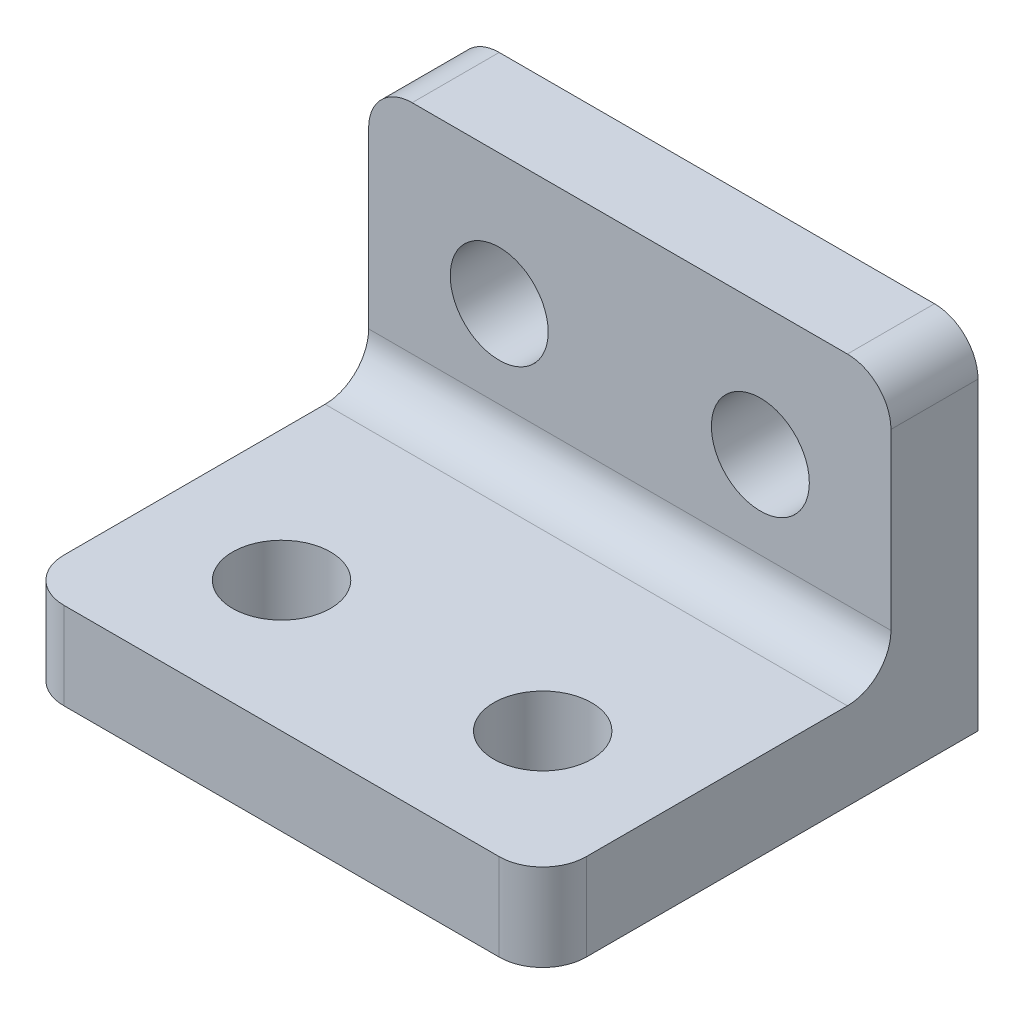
from build123d import *

# Parameters (mm, degrees)
SKETCH1_W           = 38.1
SKETCH1_H           = 25.4
SKETCH1_R           = 3.571875
BOSS_EXTRUDE1_DEPTH = 6.35
SKETCH2_W           = 38.1
SKETCH2_H           = 6.35
BOSS_EXTRUDE2_DEPTH = 25.4
SKETCH3_R           = 3.571875
CUT_EXTRUDE1_DEPTH  = 42.639734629
FILLET1_R           = 3.175


with BuildPart() as part:
    # Sketch1 → Boss-Extrude1 (new body)
    with BuildSketch(Plane.XY):
        Rectangle(SKETCH1_W, SKETCH1_H)
        with Locations((-9.525, 3.175)):
            Circle(SKETCH1_R, mode=Mode.SUBTRACT)
        with Locations((9.525, 3.175)):
            Circle(SKETCH1_R, mode=Mode.SUBTRACT)
    extrude(amount=BOSS_EXTRUDE1_DEPTH)

    # Sketch2 → Boss-Extrude2 (add)
    with BuildSketch(Plane.XY.offset(6.35)):
        with Locations((0, -9.525)):
            Rectangle(SKETCH2_W, SKETCH2_H)
    extrude(amount=BOSS_EXTRUDE2_DEPTH)

    # Sketch3 → Cut-Extrude1 (cut, through all)
    with BuildSketch(Plane(origin=(0, -6.35, 0), x_dir=(1, 0, 0), z_dir=(0, 1, 0))):
        with Locations(Location((-9.525, -22.225, 0), (0, 0, 270))):
            Circle(SKETCH3_R)
        with Locations(Location((9.525, -22.225, 0), (0, 0, 270))):
            Circle(SKETCH3_R)
    extrude(amount=-CUT_EXTRUDE1_DEPTH, mode=Mode.SUBTRACT)

    # Fillet1
    fillet1_edges = [part.edges().sort_by_distance(p)[0] for p in [
        (0, -6.35, 6.35),
        (-19.05, -9.525, 31.75),
        (19.05, -9.525, 31.75),
        (-19.05, 12.7, 3.175),
        (19.05, 12.7, 3.175),
    ]]
    fillet(fillet1_edges, radius=FILLET1_R)


solid = part.part
